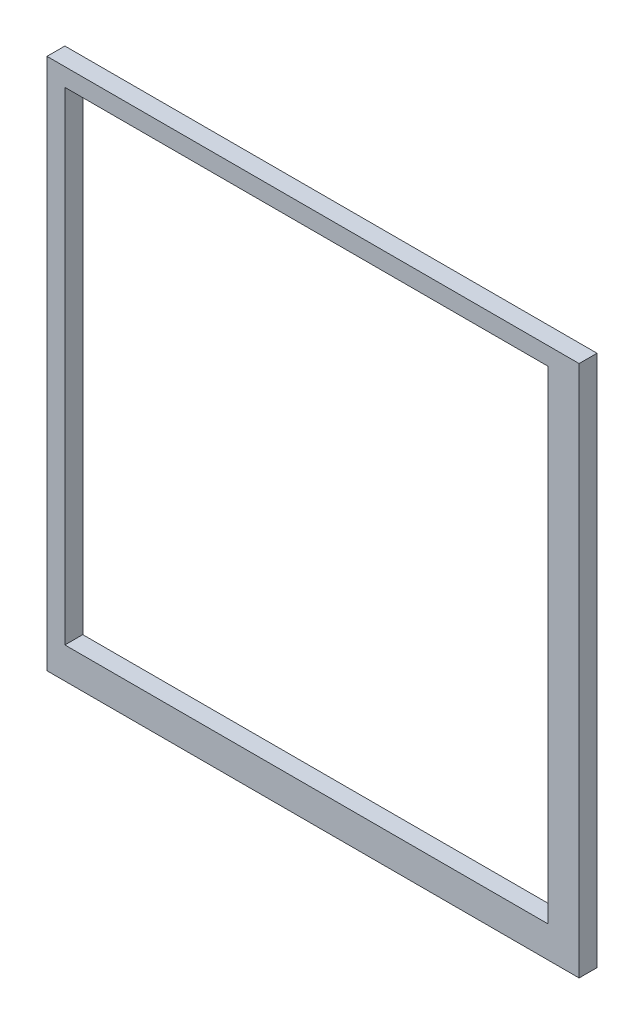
from build123d import *

# Parameters (mm, degrees)
SKETCH1_W           = 595
SKETCH1_H           = 595
SKETCH1_W_2         = 540
SKETCH1_H_2         = 540
BOSS_EXTRUDE1_DEPTH = 20


with BuildPart() as part:
    # Sketch1 → Boss-Extrude1 (new body)
    with BuildSketch(Plane.XY):
        with Locations((7.5, -7.5)):
            Rectangle(SKETCH1_W, SKETCH1_H)
        Rectangle(SKETCH1_W_2, SKETCH1_H_2, mode=Mode.SUBTRACT)
    extrude(amount=BOSS_EXTRUDE1_DEPTH)


solid = part.part
